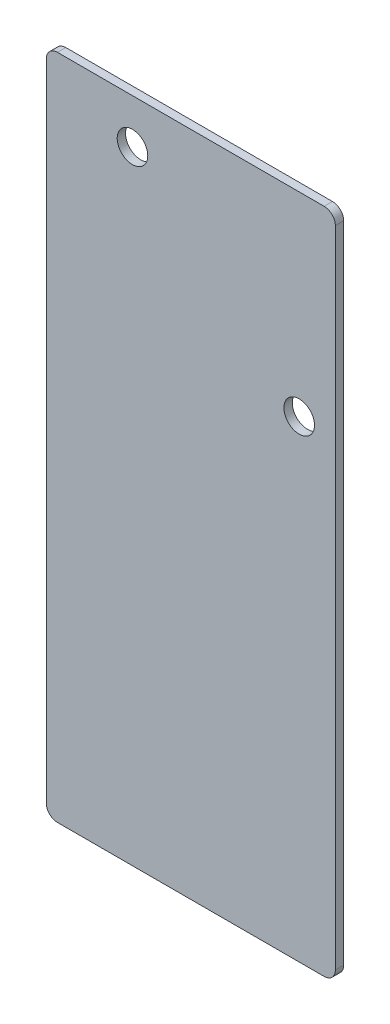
ISO-10303-21;
HEADER;
FILE_DESCRIPTION(('STEP AP214'),'2;1');
FILE_NAME('part.step','',(''),(''),'','','');
FILE_SCHEMA(('AUTOMOTIVE_DESIGN { 1 0 10303 214 1 1 1 1 }'));
ENDSEC;
DATA;
#1=APPLICATION_CONTEXT('core data for automotive mechanical design processes');
#2=APPLICATION_PROTOCOL_DEFINITION('international standard','automotive_design',2000,#1);
#3=PRODUCT_CONTEXT('',#1,'mechanical');
#4=PRODUCT('Part','Part','',(#3));
#5=PRODUCT_RELATED_PRODUCT_CATEGORY('part','',(#4));
#6=PRODUCT_DEFINITION_FORMATION('','',#4);
#7=PRODUCT_DEFINITION_CONTEXT('part definition',#1,'design');
#8=PRODUCT_DEFINITION('design','',#6,#7);
#9=PRODUCT_DEFINITION_SHAPE('','',#8);
#10=(LENGTH_UNIT() NAMED_UNIT(*) SI_UNIT(.MILLI.,.METRE.));
#11=(NAMED_UNIT(*) PLANE_ANGLE_UNIT() SI_UNIT($,.RADIAN.));
#12=(NAMED_UNIT(*) SI_UNIT($,.STERADIAN.) SOLID_ANGLE_UNIT());
#13=UNCERTAINTY_MEASURE_WITH_UNIT(LENGTH_MEASURE(1.E-05),#10,'distance_accuracy_value','');
#14=(GEOMETRIC_REPRESENTATION_CONTEXT(3) GLOBAL_UNCERTAINTY_ASSIGNED_CONTEXT((#13)) GLOBAL_UNIT_ASSIGNED_CONTEXT((#10,
#11,#12)) REPRESENTATION_CONTEXT('',''));
#15=CARTESIAN_POINT('',(0.,0.,0.));
#16=DIRECTION('',(0.,0.,1.));
#17=DIRECTION('',(1.,0.,0.));
#18=AXIS2_PLACEMENT_3D('',#15,#16,#17);
#19=CARTESIAN_POINT('',(-26.,-60.,-1.5));
#20=DIRECTION('',(-1.,0.,0.));
#21=DIRECTION('',(0.,0.,1.));
#22=AXIS2_PLACEMENT_3D('',#19,#20,#21);
#23=PLANE('',#22);
#24=DIRECTION('',(0.,-1.,0.));
#25=VECTOR('',#24,1.);
#26=CARTESIAN_POINT('',(-26.,-60.,-1.5));
#27=LINE('',#26,#25);
#28=CARTESIAN_POINT('',(-26.,58.,-1.5));
#29=VERTEX_POINT('',#28);
#30=CARTESIAN_POINT('',(-26.,-58.,-1.5));
#31=VERTEX_POINT('',#30);
#32=EDGE_CURVE('E157',#29,#31,#27,.T.);
#33=ORIENTED_EDGE('',*,*,#32,.T.);
#34=DIRECTION('',(0.,0.,1.));
#35=VECTOR('',#34,1.);
#36=CARTESIAN_POINT('',(-26.,-58.,-1.5));
#37=LINE('',#36,#35);
#38=CARTESIAN_POINT('',(-26.,-58.,0.));
#39=VERTEX_POINT('',#38);
#40=EDGE_CURVE('E153',#31,#39,#37,.T.);
#41=ORIENTED_EDGE('',*,*,#40,.T.);
#42=DIRECTION('',(0.,-1.,0.));
#43=VECTOR('',#42,1.);
#44=CARTESIAN_POINT('',(-26.,-60.,0.));
#45=LINE('',#44,#43);
#46=CARTESIAN_POINT('',(-26.,58.,0.));
#47=VERTEX_POINT('',#46);
#48=EDGE_CURVE('E106',#47,#39,#45,.T.);
#49=ORIENTED_EDGE('',*,*,#48,.F.);
#50=DIRECTION('',(0.,0.,1.));
#51=VECTOR('',#50,1.);
#52=CARTESIAN_POINT('',(-26.,58.,-1.5));
#53=LINE('',#52,#51);
#54=EDGE_CURVE('E151',#47,#29,#53,.F.);
#55=ORIENTED_EDGE('',*,*,#54,.T.);
#56=EDGE_LOOP('',(#33,#41,#49,#55));
#57=FACE_BOUND('',#56,.T.);
#58=ADVANCED_FACE('F35',(#57),#23,.T.);
#59=CARTESIAN_POINT('',(26.,60.,-1.5));
#60=DIRECTION('',(0.,1.,0.));
#61=DIRECTION('',(-1.,0.,0.));
#62=AXIS2_PLACEMENT_3D('',#59,#60,#61);
#63=PLANE('',#62);
#64=DIRECTION('',(-1.,0.,0.));
#65=VECTOR('',#64,1.);
#66=CARTESIAN_POINT('',(26.,60.,-1.5));
#67=LINE('',#66,#65);
#68=CARTESIAN_POINT('',(24.,60.,-1.5));
#69=VERTEX_POINT('',#68);
#70=CARTESIAN_POINT('',(-24.,60.,-1.5));
#71=VERTEX_POINT('',#70);
#72=EDGE_CURVE('E127',#69,#71,#67,.T.);
#73=ORIENTED_EDGE('',*,*,#72,.T.);
#74=DIRECTION('',(0.,0.,1.));
#75=VECTOR('',#74,1.);
#76=CARTESIAN_POINT('',(-24.,60.,-1.5));
#77=LINE('',#76,#75);
#78=CARTESIAN_POINT('',(-24.,60.,0.));
#79=VERTEX_POINT('',#78);
#80=EDGE_CURVE('E11',#71,#79,#77,.T.);
#81=ORIENTED_EDGE('',*,*,#80,.T.);
#82=DIRECTION('',(-1.,0.,0.));
#83=VECTOR('',#82,1.);
#84=CARTESIAN_POINT('',(26.,60.,0.));
#85=LINE('',#84,#83);
#86=CARTESIAN_POINT('',(24.,60.,0.));
#87=VERTEX_POINT('',#86);
#88=EDGE_CURVE('E134',#87,#79,#85,.T.);
#89=ORIENTED_EDGE('',*,*,#88,.F.);
#90=DIRECTION('',(0.,0.,1.));
#91=VECTOR('',#90,1.);
#92=CARTESIAN_POINT('',(24.,60.,-1.5));
#93=LINE('',#92,#91);
#94=EDGE_CURVE('E43',#87,#69,#93,.F.);
#95=ORIENTED_EDGE('',*,*,#94,.T.);
#96=EDGE_LOOP('',(#73,#81,#89,#95));
#97=FACE_BOUND('',#96,.T.);
#98=ADVANCED_FACE('F189',(#97),#63,.T.);
#99=CARTESIAN_POINT('',(26.,-60.,-1.5));
#100=DIRECTION('',(1.,0.,0.));
#101=DIRECTION('',(0.,0.,-1.));
#102=AXIS2_PLACEMENT_3D('',#99,#100,#101);
#103=PLANE('',#102);
#104=DIRECTION('',(0.,1.,0.));
#105=VECTOR('',#104,1.);
#106=CARTESIAN_POINT('',(26.,-60.,0.));
#107=LINE('',#106,#105);
#108=CARTESIAN_POINT('',(26.,-58.,0.));
#109=VERTEX_POINT('',#108);
#110=CARTESIAN_POINT('',(26.,58.,0.));
#111=VERTEX_POINT('',#110);
#112=EDGE_CURVE('E122',#109,#111,#107,.T.);
#113=ORIENTED_EDGE('',*,*,#112,.F.);
#114=DIRECTION('',(0.,0.,1.));
#115=VECTOR('',#114,1.);
#116=CARTESIAN_POINT('',(26.,-58.,-1.5));
#117=LINE('',#116,#115);
#118=CARTESIAN_POINT('',(26.,-58.,-1.5));
#119=VERTEX_POINT('',#118);
#120=EDGE_CURVE('E143',#109,#119,#117,.F.);
#121=ORIENTED_EDGE('',*,*,#120,.T.);
#122=DIRECTION('',(0.,1.,0.));
#123=VECTOR('',#122,1.);
#124=CARTESIAN_POINT('',(26.,-60.,-1.5));
#125=LINE('',#124,#123);
#126=CARTESIAN_POINT('',(26.,58.,-1.5));
#127=VERTEX_POINT('',#126);
#128=EDGE_CURVE('E131',#119,#127,#125,.T.);
#129=ORIENTED_EDGE('',*,*,#128,.T.);
#130=DIRECTION('',(0.,0.,1.));
#131=VECTOR('',#130,1.);
#132=CARTESIAN_POINT('',(26.,58.,-1.5));
#133=LINE('',#132,#131);
#134=EDGE_CURVE('E140',#127,#111,#133,.T.);
#135=ORIENTED_EDGE('',*,*,#134,.T.);
#136=EDGE_LOOP('',(#113,#121,#129,#135));
#137=FACE_BOUND('',#136,.T.);
#138=ADVANCED_FACE('F173',(#137),#103,.T.);
#139=CARTESIAN_POINT('',(26.,-60.,-1.5));
#140=DIRECTION('',(0.,-1.,0.));
#141=DIRECTION('',(1.,0.,0.));
#142=AXIS2_PLACEMENT_3D('',#139,#140,#141);
#143=PLANE('',#142);
#144=DIRECTION('',(1.,0.,0.));
#145=VECTOR('',#144,1.);
#146=CARTESIAN_POINT('',(26.,-60.,-1.5));
#147=LINE('',#146,#145);
#148=CARTESIAN_POINT('',(-24.,-60.,-1.5));
#149=VERTEX_POINT('',#148);
#150=CARTESIAN_POINT('',(24.,-60.,-1.5));
#151=VERTEX_POINT('',#150);
#152=EDGE_CURVE('E158',#149,#151,#147,.T.);
#153=ORIENTED_EDGE('',*,*,#152,.T.);
#154=DIRECTION('',(0.,0.,1.));
#155=VECTOR('',#154,1.);
#156=CARTESIAN_POINT('',(24.,-60.,-1.5));
#157=LINE('',#156,#155);
#158=CARTESIAN_POINT('',(24.,-60.,0.));
#159=VERTEX_POINT('',#158);
#160=EDGE_CURVE('E121',#151,#159,#157,.T.);
#161=ORIENTED_EDGE('',*,*,#160,.T.);
#162=DIRECTION('',(1.,0.,0.));
#163=VECTOR('',#162,1.);
#164=CARTESIAN_POINT('',(26.,-60.,0.));
#165=LINE('',#164,#163);
#166=CARTESIAN_POINT('',(-24.,-60.,0.));
#167=VERTEX_POINT('',#166);
#168=EDGE_CURVE('E104',#167,#159,#165,.T.);
#169=ORIENTED_EDGE('',*,*,#168,.F.);
#170=DIRECTION('',(0.,0.,1.));
#171=VECTOR('',#170,1.);
#172=CARTESIAN_POINT('',(-24.,-60.,-1.5));
#173=LINE('',#172,#171);
#174=EDGE_CURVE('E118',#167,#149,#173,.F.);
#175=ORIENTED_EDGE('',*,*,#174,.T.);
#176=EDGE_LOOP('',(#153,#161,#169,#175));
#177=FACE_BOUND('',#176,.T.);
#178=ADVANCED_FACE('F117',(#177),#143,.T.);
#179=CARTESIAN_POINT('',(0.,0.,-1.5));
#180=DIRECTION('',(0.,0.,1.));
#181=DIRECTION('',(1.,0.,0.));
#182=AXIS2_PLACEMENT_3D('',#179,#180,#181);
#183=PLANE('',#182);
#184=CARTESIAN_POINT('',(19.4999999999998,25.0000000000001,-1.5));
#185=DIRECTION('',(0.,0.,1.));
#186=DIRECTION('',(1.,0.,0.));
#187=AXIS2_PLACEMENT_3D('',#184,#185,#186);
#188=CIRCLE('',#187,2.75);
#189=CARTESIAN_POINT('',(22.2499999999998,25.0000000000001,-1.5));
#190=VERTEX_POINT('',#189);
#191=EDGE_CURVE('E168',#190,#190,#188,.T.);
#192=ORIENTED_EDGE('',*,*,#191,.T.);
#193=EDGE_LOOP('',(#192));
#194=FACE_BOUND('',#193,.T.);
#195=CARTESIAN_POINT('',(-10.5000000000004,51.9999999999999,-1.5));
#196=DIRECTION('',(0.,0.,1.));
#197=DIRECTION('',(1.,0.,0.));
#198=AXIS2_PLACEMENT_3D('',#195,#196,#197);
#199=CIRCLE('',#198,2.75);
#200=CARTESIAN_POINT('',(-7.75000000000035,51.9999999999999,-1.5));
#201=VERTEX_POINT('',#200);
#202=EDGE_CURVE('E306',#201,#201,#199,.T.);
#203=ORIENTED_EDGE('',*,*,#202,.T.);
#204=EDGE_LOOP('',(#203));
#205=FACE_BOUND('',#204,.T.);
#206=ORIENTED_EDGE('',*,*,#128,.F.);
#207=CARTESIAN_POINT('',(24.,-58.,-1.5));
#208=DIRECTION('',(0.,0.,1.));
#209=DIRECTION('',(1.,0.,0.));
#210=AXIS2_PLACEMENT_3D('',#207,#208,#209);
#211=CIRCLE('',#210,2.);
#212=EDGE_CURVE('E149',#119,#151,#211,.F.);
#213=ORIENTED_EDGE('',*,*,#212,.T.);
#214=ORIENTED_EDGE('',*,*,#152,.F.);
#215=CARTESIAN_POINT('',(-24.,-58.,-1.5));
#216=DIRECTION('',(0.,0.,1.));
#217=DIRECTION('',(1.,0.,0.));
#218=AXIS2_PLACEMENT_3D('',#215,#216,#217);
#219=CIRCLE('',#218,2.);
#220=EDGE_CURVE('E126',#149,#31,#219,.F.);
#221=ORIENTED_EDGE('',*,*,#220,.T.);
#222=ORIENTED_EDGE('',*,*,#32,.F.);
#223=CARTESIAN_POINT('',(-24.,58.,-1.5));
#224=DIRECTION('',(0.,0.,1.));
#225=DIRECTION('',(1.,0.,0.));
#226=AXIS2_PLACEMENT_3D('',#223,#224,#225);
#227=CIRCLE('',#226,2.);
#228=EDGE_CURVE('E50',#29,#71,#227,.F.);
#229=ORIENTED_EDGE('',*,*,#228,.T.);
#230=ORIENTED_EDGE('',*,*,#72,.F.);
#231=CARTESIAN_POINT('',(24.,58.,-1.5));
#232=DIRECTION('',(0.,0.,1.));
#233=DIRECTION('',(1.,0.,0.));
#234=AXIS2_PLACEMENT_3D('',#231,#232,#233);
#235=CIRCLE('',#234,2.);
#236=EDGE_CURVE('E145',#69,#127,#235,.F.);
#237=ORIENTED_EDGE('',*,*,#236,.T.);
#238=EDGE_LOOP('',(#206,#213,#214,#221,#222,#229,#230,#237));
#239=FACE_BOUND('',#238,.T.);
#240=ADVANCED_FACE('F179',(#194,#205,#239),#183,.F.);
#241=CARTESIAN_POINT('',(0.,0.,0.));
#242=DIRECTION('',(0.,0.,1.));
#243=DIRECTION('',(1.,0.,0.));
#244=AXIS2_PLACEMENT_3D('',#241,#242,#243);
#245=PLANE('',#244);
#246=CARTESIAN_POINT('',(19.4999999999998,25.0000000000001,0.));
#247=DIRECTION('',(0.,0.,1.));
#248=DIRECTION('',(1.,0.,0.));
#249=AXIS2_PLACEMENT_3D('',#246,#247,#248);
#250=CIRCLE('',#249,2.75);
#251=CARTESIAN_POINT('',(22.2499999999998,25.0000000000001,0.));
#252=VERTEX_POINT('',#251);
#253=EDGE_CURVE('E307',#252,#252,#250,.T.);
#254=ORIENTED_EDGE('',*,*,#253,.F.);
#255=EDGE_LOOP('',(#254));
#256=FACE_BOUND('',#255,.T.);
#257=CARTESIAN_POINT('',(-10.5000000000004,51.9999999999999,0.));
#258=DIRECTION('',(0.,0.,1.));
#259=DIRECTION('',(1.,0.,0.));
#260=AXIS2_PLACEMENT_3D('',#257,#258,#259);
#261=CIRCLE('',#260,2.75);
#262=CARTESIAN_POINT('',(-7.75000000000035,51.9999999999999,0.));
#263=VERTEX_POINT('',#262);
#264=EDGE_CURVE('E163',#263,#263,#261,.T.);
#265=ORIENTED_EDGE('',*,*,#264,.F.);
#266=EDGE_LOOP('',(#265));
#267=FACE_BOUND('',#266,.T.);
#268=ORIENTED_EDGE('',*,*,#168,.T.);
#269=CARTESIAN_POINT('',(24.,-58.,0.));
#270=DIRECTION('',(0.,0.,1.));
#271=DIRECTION('',(1.,0.,0.));
#272=AXIS2_PLACEMENT_3D('',#269,#270,#271);
#273=CIRCLE('',#272,2.);
#274=EDGE_CURVE('E111',#159,#109,#273,.T.);
#275=ORIENTED_EDGE('',*,*,#274,.T.);
#276=ORIENTED_EDGE('',*,*,#112,.T.);
#277=CARTESIAN_POINT('',(24.,58.,0.));
#278=DIRECTION('',(0.,0.,1.));
#279=DIRECTION('',(1.,0.,0.));
#280=AXIS2_PLACEMENT_3D('',#277,#278,#279);
#281=CIRCLE('',#280,2.);
#282=EDGE_CURVE('E129',#111,#87,#281,.T.);
#283=ORIENTED_EDGE('',*,*,#282,.T.);
#284=ORIENTED_EDGE('',*,*,#88,.T.);
#285=CARTESIAN_POINT('',(-24.,58.,0.));
#286=DIRECTION('',(0.,0.,1.));
#287=DIRECTION('',(1.,0.,0.));
#288=AXIS2_PLACEMENT_3D('',#285,#286,#287);
#289=CIRCLE('',#288,2.);
#290=EDGE_CURVE('E112',#79,#47,#289,.T.);
#291=ORIENTED_EDGE('',*,*,#290,.T.);
#292=ORIENTED_EDGE('',*,*,#48,.T.);
#293=CARTESIAN_POINT('',(-24.,-58.,0.));
#294=DIRECTION('',(0.,0.,1.));
#295=DIRECTION('',(1.,0.,0.));
#296=AXIS2_PLACEMENT_3D('',#293,#294,#295);
#297=CIRCLE('',#296,2.);
#298=EDGE_CURVE('E101',#39,#167,#297,.T.);
#299=ORIENTED_EDGE('',*,*,#298,.T.);
#300=EDGE_LOOP('',(#268,#275,#276,#283,#284,#291,#292,#299));
#301=FACE_BOUND('',#300,.T.);
#302=ADVANCED_FACE('F103',(#256,#267,#301),#245,.T.);
#303=CARTESIAN_POINT('',(-10.5000000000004,51.9999999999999,-1.5));
#304=DIRECTION('',(0.,0.,1.));
#305=DIRECTION('',(1.,0.,0.));
#306=AXIS2_PLACEMENT_3D('',#303,#304,#305);
#307=CYLINDRICAL_SURFACE('',#306,2.75);
#308=ORIENTED_EDGE('',*,*,#202,.F.);
#309=EDGE_LOOP('',(#308));
#310=FACE_BOUND('',#309,.T.);
#311=ORIENTED_EDGE('',*,*,#264,.T.);
#312=EDGE_LOOP('',(#311));
#313=FACE_BOUND('',#312,.T.);
#314=ADVANCED_FACE('F232',(#310,#313),#307,.F.);
#315=CARTESIAN_POINT('',(19.4999999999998,25.0000000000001,-1.5));
#316=DIRECTION('',(0.,0.,1.));
#317=DIRECTION('',(1.,0.,0.));
#318=AXIS2_PLACEMENT_3D('',#315,#316,#317);
#319=CYLINDRICAL_SURFACE('',#318,2.75);
#320=ORIENTED_EDGE('',*,*,#191,.F.);
#321=EDGE_LOOP('',(#320));
#322=FACE_BOUND('',#321,.T.);
#323=ORIENTED_EDGE('',*,*,#253,.T.);
#324=EDGE_LOOP('',(#323));
#325=FACE_BOUND('',#324,.T.);
#326=ADVANCED_FACE('F200',(#322,#325),#319,.F.);
#327=CARTESIAN_POINT('',(24.,-58.,-1.5));
#328=DIRECTION('',(0.,0.,1.));
#329=DIRECTION('',(1.,0.,0.));
#330=AXIS2_PLACEMENT_3D('',#327,#328,#329);
#331=CYLINDRICAL_SURFACE('',#330,2.);
#332=ORIENTED_EDGE('',*,*,#212,.F.);
#333=ORIENTED_EDGE('',*,*,#120,.F.);
#334=ORIENTED_EDGE('',*,*,#274,.F.);
#335=ORIENTED_EDGE('',*,*,#160,.F.);
#336=EDGE_LOOP('',(#332,#333,#334,#335));
#337=FACE_BOUND('',#336,.T.);
#338=ADVANCED_FACE('F178',(#337),#331,.T.);
#339=CARTESIAN_POINT('',(-24.,-58.,-1.5));
#340=DIRECTION('',(0.,0.,1.));
#341=DIRECTION('',(1.,0.,0.));
#342=AXIS2_PLACEMENT_3D('',#339,#340,#341);
#343=CYLINDRICAL_SURFACE('',#342,2.);
#344=ORIENTED_EDGE('',*,*,#220,.F.);
#345=ORIENTED_EDGE('',*,*,#174,.F.);
#346=ORIENTED_EDGE('',*,*,#298,.F.);
#347=ORIENTED_EDGE('',*,*,#40,.F.);
#348=EDGE_LOOP('',(#344,#345,#346,#347));
#349=FACE_BOUND('',#348,.T.);
#350=ADVANCED_FACE('F125',(#349),#343,.T.);
#351=CARTESIAN_POINT('',(-24.,58.,-1.5));
#352=DIRECTION('',(0.,0.,1.));
#353=DIRECTION('',(1.,0.,0.));
#354=AXIS2_PLACEMENT_3D('',#351,#352,#353);
#355=CYLINDRICAL_SURFACE('',#354,2.);
#356=ORIENTED_EDGE('',*,*,#228,.F.);
#357=ORIENTED_EDGE('',*,*,#54,.F.);
#358=ORIENTED_EDGE('',*,*,#290,.F.);
#359=ORIENTED_EDGE('',*,*,#80,.F.);
#360=EDGE_LOOP('',(#356,#357,#358,#359));
#361=FACE_BOUND('',#360,.T.);
#362=ADVANCED_FACE('F183',(#361),#355,.T.);
#363=CARTESIAN_POINT('',(24.,58.,-1.5));
#364=DIRECTION('',(0.,0.,1.));
#365=DIRECTION('',(1.,0.,0.));
#366=AXIS2_PLACEMENT_3D('',#363,#364,#365);
#367=CYLINDRICAL_SURFACE('',#366,2.);
#368=ORIENTED_EDGE('',*,*,#236,.F.);
#369=ORIENTED_EDGE('',*,*,#94,.F.);
#370=ORIENTED_EDGE('',*,*,#282,.F.);
#371=ORIENTED_EDGE('',*,*,#134,.F.);
#372=EDGE_LOOP('',(#368,#369,#370,#371));
#373=FACE_BOUND('',#372,.T.);
#374=ADVANCED_FACE('F37',(#373),#367,.T.);
#375=CLOSED_SHELL('',(#58,#98,#138,#178,#240,#302,#314,#326,#338,#350,#362,#374));
#376=MANIFOLD_SOLID_BREP('B2',#375);
#377=ADVANCED_BREP_SHAPE_REPRESENTATION('',(#18,#376),#14);
#378=SHAPE_DEFINITION_REPRESENTATION(#9,#377);
ENDSEC;
END-ISO-10303-21;
